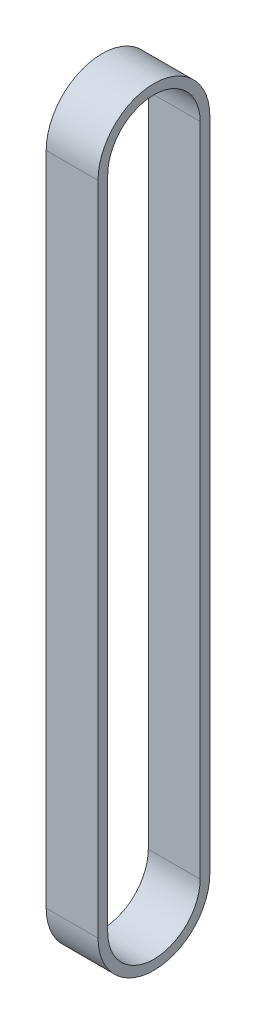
ISO-10303-21;
HEADER;
FILE_DESCRIPTION(('STEP AP214'),'2;1');
FILE_NAME('part.step','',(''),(''),'','','');
FILE_SCHEMA(('AUTOMOTIVE_DESIGN { 1 0 10303 214 1 1 1 1 }'));
ENDSEC;
DATA;
#1=APPLICATION_CONTEXT('core data for automotive mechanical design processes');
#2=APPLICATION_PROTOCOL_DEFINITION('international standard','automotive_design',2000,#1);
#3=PRODUCT_CONTEXT('',#1,'mechanical');
#4=PRODUCT('Part','Part','',(#3));
#5=PRODUCT_RELATED_PRODUCT_CATEGORY('part','',(#4));
#6=PRODUCT_DEFINITION_FORMATION('','',#4);
#7=PRODUCT_DEFINITION_CONTEXT('part definition',#1,'design');
#8=PRODUCT_DEFINITION('design','',#6,#7);
#9=PRODUCT_DEFINITION_SHAPE('','',#8);
#10=(LENGTH_UNIT() NAMED_UNIT(*) SI_UNIT(.MILLI.,.METRE.));
#11=(NAMED_UNIT(*) PLANE_ANGLE_UNIT() SI_UNIT($,.RADIAN.));
#12=(NAMED_UNIT(*) SI_UNIT($,.STERADIAN.) SOLID_ANGLE_UNIT());
#13=UNCERTAINTY_MEASURE_WITH_UNIT(LENGTH_MEASURE(1.E-05),#10,'distance_accuracy_value','');
#14=(GEOMETRIC_REPRESENTATION_CONTEXT(3) GLOBAL_UNCERTAINTY_ASSIGNED_CONTEXT((#13)) GLOBAL_UNIT_ASSIGNED_CONTEXT((#10,
#11,#12)) REPRESENTATION_CONTEXT('',''));
#15=CARTESIAN_POINT('',(0.,0.,0.));
#16=DIRECTION('',(0.,0.,1.));
#17=DIRECTION('',(1.,0.,0.));
#18=AXIS2_PLACEMENT_3D('',#15,#16,#17);
#19=CARTESIAN_POINT('',(-3.2,40.5,6.9));
#20=DIRECTION('',(0.,0.,1.));
#21=DIRECTION('',(1.,0.,0.));
#22=AXIS2_PLACEMENT_3D('',#19,#20,#21);
#23=PLANE('',#22);
#24=DIRECTION('',(1.,0.,0.));
#25=VECTOR('',#24,1.);
#26=CARTESIAN_POINT('',(-3.2,40.5,6.9));
#27=LINE('',#26,#25);
#28=CARTESIAN_POINT('',(-3.2,40.5,6.9));
#29=VERTEX_POINT('',#28);
#30=CARTESIAN_POINT('',(3.2,40.5,6.9));
#31=VERTEX_POINT('',#30);
#32=EDGE_CURVE('E81',#29,#31,#27,.T.);
#33=ORIENTED_EDGE('',*,*,#32,.F.);
#34=DIRECTION('',(0.,1.,0.));
#35=VECTOR('',#34,1.);
#36=CARTESIAN_POINT('',(-3.2,0.,6.9));
#37=LINE('',#36,#35);
#38=CARTESIAN_POINT('',(-3.2,-40.5,6.9));
#39=VERTEX_POINT('',#38);
#40=EDGE_CURVE('E137',#29,#39,#37,.F.);
#41=ORIENTED_EDGE('',*,*,#40,.T.);
#42=DIRECTION('',(1.,0.,0.));
#43=VECTOR('',#42,1.);
#44=CARTESIAN_POINT('',(-3.2,-40.5,6.9));
#45=LINE('',#44,#43);
#46=CARTESIAN_POINT('',(3.2,-40.5,6.9));
#47=VERTEX_POINT('',#46);
#48=EDGE_CURVE('E125',#47,#39,#45,.F.);
#49=ORIENTED_EDGE('',*,*,#48,.F.);
#50=DIRECTION('',(0.,1.,0.));
#51=VECTOR('',#50,1.);
#52=CARTESIAN_POINT('',(3.2,0.,6.9));
#53=LINE('',#52,#51);
#54=EDGE_CURVE('E84',#31,#47,#53,.F.);
#55=ORIENTED_EDGE('',*,*,#54,.F.);
#56=EDGE_LOOP('',(#33,#41,#49,#55));
#57=FACE_BOUND('',#56,.T.);
#58=ADVANCED_FACE('F17',(#57),#23,.T.);
#59=CARTESIAN_POINT('',(-3.2,40.5,-5.7));
#60=DIRECTION('',(0.,0.,1.));
#61=DIRECTION('',(1.,0.,0.));
#62=AXIS2_PLACEMENT_3D('',#59,#60,#61);
#63=PLANE('',#62);
#64=DIRECTION('',(1.,0.,0.));
#65=VECTOR('',#64,1.);
#66=CARTESIAN_POINT('',(-3.2,40.5,-5.7));
#67=LINE('',#66,#65);
#68=CARTESIAN_POINT('',(3.2,40.5,-5.7));
#69=VERTEX_POINT('',#68);
#70=CARTESIAN_POINT('',(-3.2,40.5,-5.7));
#71=VERTEX_POINT('',#70);
#72=EDGE_CURVE('E113',#69,#71,#67,.F.);
#73=ORIENTED_EDGE('',*,*,#72,.T.);
#74=DIRECTION('',(0.,1.,0.));
#75=VECTOR('',#74,1.);
#76=CARTESIAN_POINT('',(-3.2,0.,-5.7));
#77=LINE('',#76,#75);
#78=CARTESIAN_POINT('',(-3.2,-40.5,-5.7));
#79=VERTEX_POINT('',#78);
#80=EDGE_CURVE('E134',#71,#79,#77,.F.);
#81=ORIENTED_EDGE('',*,*,#80,.T.);
#82=DIRECTION('',(1.,0.,0.));
#83=VECTOR('',#82,1.);
#84=CARTESIAN_POINT('',(-3.2,-40.5,-5.7));
#85=LINE('',#84,#83);
#86=CARTESIAN_POINT('',(3.2,-40.5,-5.7));
#87=VERTEX_POINT('',#86);
#88=EDGE_CURVE('E122',#79,#87,#85,.T.);
#89=ORIENTED_EDGE('',*,*,#88,.T.);
#90=DIRECTION('',(0.,1.,0.));
#91=VECTOR('',#90,1.);
#92=CARTESIAN_POINT('',(3.2,0.,-5.7));
#93=LINE('',#92,#91);
#94=EDGE_CURVE('E102',#69,#87,#93,.F.);
#95=ORIENTED_EDGE('',*,*,#94,.F.);
#96=EDGE_LOOP('',(#73,#81,#89,#95));
#97=FACE_BOUND('',#96,.T.);
#98=ADVANCED_FACE('F168',(#97),#63,.T.);
#99=CARTESIAN_POINT('',(-3.2,-40.5,0.));
#100=DIRECTION('',(1.,0.,0.));
#101=DIRECTION('',(0.,0.,-1.));
#102=AXIS2_PLACEMENT_3D('',#99,#100,#101);
#103=CYLINDRICAL_SURFACE('',#102,5.7);
#104=CARTESIAN_POINT('',(3.2,-40.5,0.));
#105=DIRECTION('',(1.,0.,0.));
#106=DIRECTION('',(0.,0.,-1.));
#107=AXIS2_PLACEMENT_3D('',#104,#105,#106);
#108=CIRCLE('',#107,5.7);
#109=CARTESIAN_POINT('',(3.2,-40.5,5.7));
#110=VERTEX_POINT('',#109);
#111=EDGE_CURVE('E83',#87,#110,#108,.F.);
#112=ORIENTED_EDGE('',*,*,#111,.F.);
#113=ORIENTED_EDGE('',*,*,#88,.F.);
#114=CARTESIAN_POINT('',(-3.2,-40.5,0.));
#115=DIRECTION('',(1.,0.,0.));
#116=DIRECTION('',(0.,0.,-1.));
#117=AXIS2_PLACEMENT_3D('',#114,#115,#116);
#118=CIRCLE('',#117,5.7);
#119=CARTESIAN_POINT('',(-3.2,-40.5,5.7));
#120=VERTEX_POINT('',#119);
#121=EDGE_CURVE('E130',#79,#120,#118,.F.);
#122=ORIENTED_EDGE('',*,*,#121,.T.);
#123=DIRECTION('',(-1.,0.,0.));
#124=VECTOR('',#123,1.);
#125=CARTESIAN_POINT('',(-3.2,-40.5,5.7));
#126=LINE('',#125,#124);
#127=EDGE_CURVE('E118',#110,#120,#126,.T.);
#128=ORIENTED_EDGE('',*,*,#127,.F.);
#129=EDGE_LOOP('',(#112,#113,#122,#128));
#130=FACE_BOUND('',#129,.T.);
#131=ADVANCED_FACE('F151',(#130),#103,.F.);
#132=CARTESIAN_POINT('',(-3.2,-40.5,5.7));
#133=DIRECTION('',(0.,0.,-1.));
#134=DIRECTION('',(-1.,0.,0.));
#135=AXIS2_PLACEMENT_3D('',#132,#133,#134);
#136=PLANE('',#135);
#137=ORIENTED_EDGE('',*,*,#127,.T.);
#138=DIRECTION('',(0.,1.,0.));
#139=VECTOR('',#138,1.);
#140=CARTESIAN_POINT('',(-3.2,0.,5.7));
#141=LINE('',#140,#139);
#142=CARTESIAN_POINT('',(-3.2,40.5,5.7));
#143=VERTEX_POINT('',#142);
#144=EDGE_CURVE('E98',#120,#143,#141,.T.);
#145=ORIENTED_EDGE('',*,*,#144,.T.);
#146=DIRECTION('',(1.,0.,0.));
#147=VECTOR('',#146,1.);
#148=CARTESIAN_POINT('',(-3.2,40.5,5.7));
#149=LINE('',#148,#147);
#150=CARTESIAN_POINT('',(3.2,40.5,5.7));
#151=VERTEX_POINT('',#150);
#152=EDGE_CURVE('E116',#143,#151,#149,.T.);
#153=ORIENTED_EDGE('',*,*,#152,.T.);
#154=DIRECTION('',(0.,1.,0.));
#155=VECTOR('',#154,1.);
#156=CARTESIAN_POINT('',(3.2,0.,5.7));
#157=LINE('',#156,#155);
#158=EDGE_CURVE('E107',#110,#151,#157,.T.);
#159=ORIENTED_EDGE('',*,*,#158,.F.);
#160=EDGE_LOOP('',(#137,#145,#153,#159));
#161=FACE_BOUND('',#160,.T.);
#162=ADVANCED_FACE('F158',(#161),#136,.T.);
#163=CARTESIAN_POINT('',(-3.2,40.5,0.));
#164=DIRECTION('',(1.,0.,0.));
#165=DIRECTION('',(0.,0.,-1.));
#166=AXIS2_PLACEMENT_3D('',#163,#164,#165);
#167=CYLINDRICAL_SURFACE('',#166,5.7);
#168=CARTESIAN_POINT('',(3.2,40.5,0.));
#169=DIRECTION('',(1.,0.,0.));
#170=DIRECTION('',(0.,0.,-1.));
#171=AXIS2_PLACEMENT_3D('',#168,#169,#170);
#172=CIRCLE('',#171,5.7);
#173=EDGE_CURVE('E106',#151,#69,#172,.F.);
#174=ORIENTED_EDGE('',*,*,#173,.F.);
#175=ORIENTED_EDGE('',*,*,#152,.F.);
#176=CARTESIAN_POINT('',(-3.2,40.5,0.));
#177=DIRECTION('',(1.,0.,0.));
#178=DIRECTION('',(0.,0.,-1.));
#179=AXIS2_PLACEMENT_3D('',#176,#177,#178);
#180=CIRCLE('',#179,5.7);
#181=EDGE_CURVE('E95',#143,#71,#180,.F.);
#182=ORIENTED_EDGE('',*,*,#181,.T.);
#183=ORIENTED_EDGE('',*,*,#72,.F.);
#184=EDGE_LOOP('',(#174,#175,#182,#183));
#185=FACE_BOUND('',#184,.T.);
#186=ADVANCED_FACE('F163',(#185),#167,.F.);
#187=CARTESIAN_POINT('',(-3.2,40.5,0.));
#188=DIRECTION('',(1.,0.,0.));
#189=DIRECTION('',(0.,0.,-1.));
#190=AXIS2_PLACEMENT_3D('',#187,#188,#189);
#191=CYLINDRICAL_SURFACE('',#190,6.9);
#192=DIRECTION('',(-1.,0.,0.));
#193=VECTOR('',#192,1.);
#194=CARTESIAN_POINT('',(-3.2,40.5,-6.9));
#195=LINE('',#194,#193);
#196=CARTESIAN_POINT('',(-3.2,40.5,-6.9));
#197=VERTEX_POINT('',#196);
#198=CARTESIAN_POINT('',(3.2,40.5,-6.9));
#199=VERTEX_POINT('',#198);
#200=EDGE_CURVE('E79',#197,#199,#195,.F.);
#201=ORIENTED_EDGE('',*,*,#200,.F.);
#202=CARTESIAN_POINT('',(-3.2,40.5,0.));
#203=DIRECTION('',(1.,0.,0.));
#204=DIRECTION('',(0.,0.,-1.));
#205=AXIS2_PLACEMENT_3D('',#202,#203,#204);
#206=CIRCLE('',#205,6.9);
#207=EDGE_CURVE('E128',#197,#29,#206,.T.);
#208=ORIENTED_EDGE('',*,*,#207,.T.);
#209=ORIENTED_EDGE('',*,*,#32,.T.);
#210=CARTESIAN_POINT('',(3.2,40.5,0.));
#211=DIRECTION('',(1.,0.,0.));
#212=DIRECTION('',(0.,0.,-1.));
#213=AXIS2_PLACEMENT_3D('',#210,#211,#212);
#214=CIRCLE('',#213,6.9);
#215=EDGE_CURVE('E20',#199,#31,#214,.T.);
#216=ORIENTED_EDGE('',*,*,#215,.F.);
#217=EDGE_LOOP('',(#201,#208,#209,#216));
#218=FACE_BOUND('',#217,.T.);
#219=ADVANCED_FACE('F76',(#218),#191,.T.);
#220=CARTESIAN_POINT('',(3.2,0.,0.));
#221=DIRECTION('',(1.,0.,0.));
#222=DIRECTION('',(0.,0.,-1.));
#223=AXIS2_PLACEMENT_3D('',#220,#221,#222);
#224=PLANE('',#223);
#225=ORIENTED_EDGE('',*,*,#173,.T.);
#226=ORIENTED_EDGE('',*,*,#94,.T.);
#227=ORIENTED_EDGE('',*,*,#111,.T.);
#228=ORIENTED_EDGE('',*,*,#158,.T.);
#229=EDGE_LOOP('',(#225,#226,#227,#228));
#230=FACE_BOUND('',#229,.T.);
#231=DIRECTION('',(0.,1.,0.));
#232=VECTOR('',#231,1.);
#233=CARTESIAN_POINT('',(3.2,-40.5,-6.9));
#234=LINE('',#233,#232);
#235=CARTESIAN_POINT('',(3.2,-40.5,-6.9));
#236=VERTEX_POINT('',#235);
#237=EDGE_CURVE('E86',#199,#236,#234,.F.);
#238=ORIENTED_EDGE('',*,*,#237,.F.);
#239=ORIENTED_EDGE('',*,*,#215,.T.);
#240=ORIENTED_EDGE('',*,*,#54,.T.);
#241=CARTESIAN_POINT('',(3.2,-40.5,0.));
#242=DIRECTION('',(1.,0.,0.));
#243=DIRECTION('',(0.,0.,-1.));
#244=AXIS2_PLACEMENT_3D('',#241,#242,#243);
#245=CIRCLE('',#244,6.9);
#246=EDGE_CURVE('E89',#236,#47,#245,.F.);
#247=ORIENTED_EDGE('',*,*,#246,.F.);
#248=EDGE_LOOP('',(#238,#239,#240,#247));
#249=FACE_BOUND('',#248,.T.);
#250=ADVANCED_FACE('F87',(#230,#249),#224,.T.);
#251=CARTESIAN_POINT('',(-3.2,-40.5,0.));
#252=DIRECTION('',(1.,0.,0.));
#253=DIRECTION('',(0.,0.,-1.));
#254=AXIS2_PLACEMENT_3D('',#251,#252,#253);
#255=CYLINDRICAL_SURFACE('',#254,6.9);
#256=ORIENTED_EDGE('',*,*,#48,.T.);
#257=CARTESIAN_POINT('',(-3.2,-40.5,0.));
#258=DIRECTION('',(1.,0.,0.));
#259=DIRECTION('',(0.,0.,-1.));
#260=AXIS2_PLACEMENT_3D('',#257,#258,#259);
#261=CIRCLE('',#260,6.9);
#262=CARTESIAN_POINT('',(-3.2,-40.5,-6.9));
#263=VERTEX_POINT('',#262);
#264=EDGE_CURVE('E39',#39,#263,#261,.T.);
#265=ORIENTED_EDGE('',*,*,#264,.T.);
#266=DIRECTION('',(-1.,0.,0.));
#267=VECTOR('',#266,1.);
#268=CARTESIAN_POINT('',(-3.2,-40.5,-6.9));
#269=LINE('',#268,#267);
#270=EDGE_CURVE('E27',#236,#263,#269,.T.);
#271=ORIENTED_EDGE('',*,*,#270,.F.);
#272=ORIENTED_EDGE('',*,*,#246,.T.);
#273=EDGE_LOOP('',(#256,#265,#271,#272));
#274=FACE_BOUND('',#273,.T.);
#275=ADVANCED_FACE('F178',(#274),#255,.T.);
#276=CARTESIAN_POINT('',(-3.2,0.,0.));
#277=DIRECTION('',(1.,0.,0.));
#278=DIRECTION('',(0.,0.,-1.));
#279=AXIS2_PLACEMENT_3D('',#276,#277,#278);
#280=PLANE('',#279);
#281=ORIENTED_EDGE('',*,*,#144,.F.);
#282=ORIENTED_EDGE('',*,*,#121,.F.);
#283=ORIENTED_EDGE('',*,*,#80,.F.);
#284=ORIENTED_EDGE('',*,*,#181,.F.);
#285=EDGE_LOOP('',(#281,#282,#283,#284));
#286=FACE_BOUND('',#285,.T.);
#287=ORIENTED_EDGE('',*,*,#264,.F.);
#288=ORIENTED_EDGE('',*,*,#40,.F.);
#289=ORIENTED_EDGE('',*,*,#207,.F.);
#290=DIRECTION('',(0.,1.,0.));
#291=VECTOR('',#290,1.);
#292=CARTESIAN_POINT('',(-3.2,-40.5,-6.9));
#293=LINE('',#292,#291);
#294=EDGE_CURVE('E11',#263,#197,#293,.T.);
#295=ORIENTED_EDGE('',*,*,#294,.F.);
#296=EDGE_LOOP('',(#287,#288,#289,#295));
#297=FACE_BOUND('',#296,.T.);
#298=ADVANCED_FACE('F185',(#286,#297),#280,.F.);
#299=CARTESIAN_POINT('',(-3.2,-40.5,-6.9));
#300=DIRECTION('',(0.,0.,-1.));
#301=DIRECTION('',(-1.,0.,0.));
#302=AXIS2_PLACEMENT_3D('',#299,#300,#301);
#303=PLANE('',#302);
#304=ORIENTED_EDGE('',*,*,#270,.T.);
#305=ORIENTED_EDGE('',*,*,#294,.T.);
#306=ORIENTED_EDGE('',*,*,#200,.T.);
#307=ORIENTED_EDGE('',*,*,#237,.T.);
#308=EDGE_LOOP('',(#304,#305,#306,#307));
#309=FACE_BOUND('',#308,.T.);
#310=ADVANCED_FACE('F94',(#309),#303,.T.);
#311=CLOSED_SHELL('',(#58,#98,#131,#162,#186,#219,#250,#275,#298,#310));
#312=MANIFOLD_SOLID_BREP('B1',#311);
#313=ADVANCED_BREP_SHAPE_REPRESENTATION('',(#18,#312),#14);
#314=SHAPE_DEFINITION_REPRESENTATION(#9,#313);
ENDSEC;
END-ISO-10303-21;
